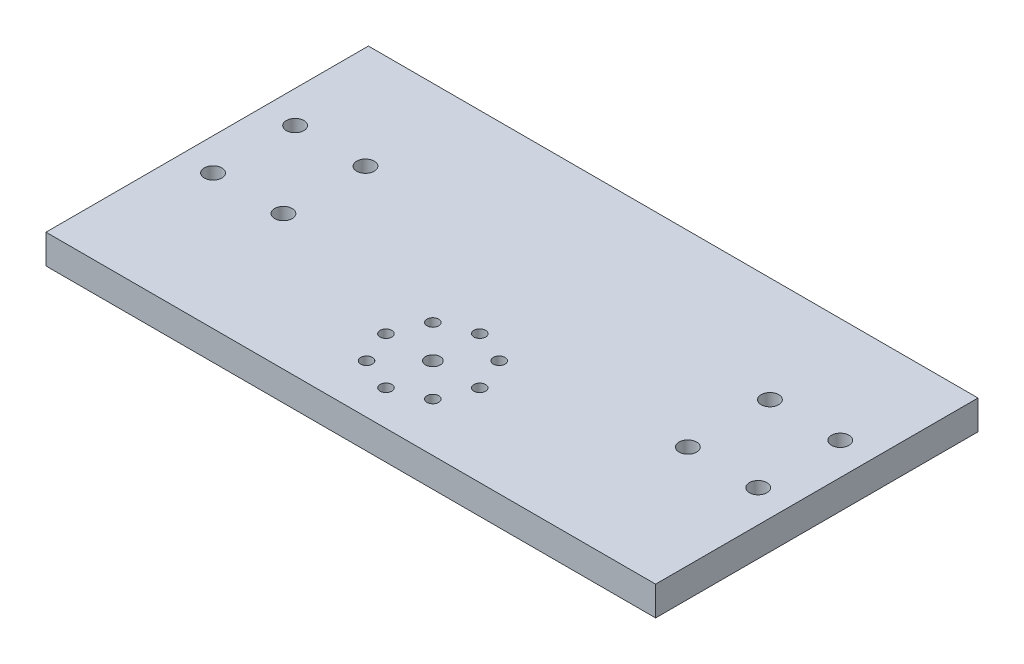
ISO-10303-21;
HEADER;
FILE_DESCRIPTION(('STEP AP214'),'2;1');
FILE_NAME('part.step','',(''),(''),'','','');
FILE_SCHEMA(('AUTOMOTIVE_DESIGN { 1 0 10303 214 1 1 1 1 }'));
ENDSEC;
DATA;
#1=APPLICATION_CONTEXT('core data for automotive mechanical design processes');
#2=APPLICATION_PROTOCOL_DEFINITION('international standard','automotive_design',2000,#1);
#3=PRODUCT_CONTEXT('',#1,'mechanical');
#4=PRODUCT('Part','Part','',(#3));
#5=PRODUCT_RELATED_PRODUCT_CATEGORY('part','',(#4));
#6=PRODUCT_DEFINITION_FORMATION('','',#4);
#7=PRODUCT_DEFINITION_CONTEXT('part definition',#1,'design');
#8=PRODUCT_DEFINITION('design','',#6,#7);
#9=PRODUCT_DEFINITION_SHAPE('','',#8);
#10=(LENGTH_UNIT() NAMED_UNIT(*) SI_UNIT(.MILLI.,.METRE.));
#11=(NAMED_UNIT(*) PLANE_ANGLE_UNIT() SI_UNIT($,.RADIAN.));
#12=(NAMED_UNIT(*) SI_UNIT($,.STERADIAN.) SOLID_ANGLE_UNIT());
#13=UNCERTAINTY_MEASURE_WITH_UNIT(LENGTH_MEASURE(1.E-05),#10,'distance_accuracy_value','');
#14=(GEOMETRIC_REPRESENTATION_CONTEXT(3) GLOBAL_UNCERTAINTY_ASSIGNED_CONTEXT((#13)) GLOBAL_UNIT_ASSIGNED_CONTEXT((#10,
#11,#12)) REPRESENTATION_CONTEXT('',''));
#15=CARTESIAN_POINT('',(0.,0.,0.));
#16=DIRECTION('',(0.,0.,1.));
#17=DIRECTION('',(1.,0.,0.));
#18=AXIS2_PLACEMENT_3D('',#15,#16,#17);
#19=CARTESIAN_POINT('',(0.,5.,16.));
#20=DIRECTION('',(0.,-1.,0.));
#21=DIRECTION('',(0.,0.,-1.));
#22=AXIS2_PLACEMENT_3D('',#19,#20,#21);
#23=CYLINDRICAL_SURFACE('',#22,1.25);
#24=CARTESIAN_POINT('',(0.,5.,16.));
#25=DIRECTION('',(0.,-1.,0.));
#26=DIRECTION('',(0.,0.,-1.));
#27=AXIS2_PLACEMENT_3D('',#24,#25,#26);
#28=CIRCLE('',#27,1.25);
#29=CARTESIAN_POINT('',(0.,5.,14.75));
#30=VERTEX_POINT('',#29);
#31=EDGE_CURVE('E113',#30,#30,#28,.T.);
#32=ORIENTED_EDGE('',*,*,#31,.F.);
#33=EDGE_LOOP('',(#32));
#34=FACE_BOUND('',#33,.T.);
#35=CARTESIAN_POINT('',(0.,2.,16.));
#36=DIRECTION('',(0.,-1.,0.));
#37=DIRECTION('',(0.,0.,-1.));
#38=AXIS2_PLACEMENT_3D('',#35,#36,#37);
#39=CIRCLE('',#38,1.25);
#40=CARTESIAN_POINT('',(0.,2.,14.75));
#41=VERTEX_POINT('',#40);
#42=EDGE_CURVE('E48',#41,#41,#39,.F.);
#43=ORIENTED_EDGE('',*,*,#42,.F.);
#44=EDGE_LOOP('',(#43));
#45=FACE_BOUND('',#44,.T.);
#46=ADVANCED_FACE('F44',(#34,#45),#23,.F.);
#47=CARTESIAN_POINT('',(0.,5.,0.));
#48=DIRECTION('',(0.,-1.,0.));
#49=DIRECTION('',(0.,0.,-1.));
#50=AXIS2_PLACEMENT_3D('',#47,#48,#49);
#51=PLANE('',#50);
#52=CARTESIAN_POINT('',(0.,5.,24.));
#53=DIRECTION('',(0.,-1.,0.));
#54=DIRECTION('',(0.,0.,-1.));
#55=AXIS2_PLACEMENT_3D('',#52,#53,#54);
#56=CIRCLE('',#55,1.);
#57=CARTESIAN_POINT('',(0.,5.,23.));
#58=VERTEX_POINT('',#57);
#59=EDGE_CURVE('E626',#58,#58,#56,.T.);
#60=ORIENTED_EDGE('',*,*,#59,.T.);
#61=EDGE_LOOP('',(#60));
#62=FACE_BOUND('',#61,.T.);
#63=CARTESIAN_POINT('',(5.65685424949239,5.,21.6568542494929));
#64=DIRECTION('',(0.,-1.,0.));
#65=DIRECTION('',(0.,0.,-1.));
#66=AXIS2_PLACEMENT_3D('',#63,#64,#65);
#67=CIRCLE('',#66,1.);
#68=CARTESIAN_POINT('',(5.65685424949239,5.,20.6568542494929));
#69=VERTEX_POINT('',#68);
#70=EDGE_CURVE('E634',#69,#69,#67,.T.);
#71=ORIENTED_EDGE('',*,*,#70,.T.);
#72=EDGE_LOOP('',(#71));
#73=FACE_BOUND('',#72,.T.);
#74=CARTESIAN_POINT('',(8.00000000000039,5.,16.0000000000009));
#75=DIRECTION('',(0.,-1.,0.));
#76=DIRECTION('',(0.,0.,-1.));
#77=AXIS2_PLACEMENT_3D('',#74,#75,#76);
#78=CIRCLE('',#77,1.);
#79=CARTESIAN_POINT('',(8.00000000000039,5.,15.0000000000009));
#80=VERTEX_POINT('',#79);
#81=EDGE_CURVE('E642',#80,#80,#78,.T.);
#82=ORIENTED_EDGE('',*,*,#81,.T.);
#83=EDGE_LOOP('',(#82));
#84=FACE_BOUND('',#83,.T.);
#85=CARTESIAN_POINT('',(5.65685424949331,5.,10.3431457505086));
#86=DIRECTION('',(0.,-1.,0.));
#87=DIRECTION('',(0.,0.,-1.));
#88=AXIS2_PLACEMENT_3D('',#85,#86,#87);
#89=CIRCLE('',#88,1.);
#90=CARTESIAN_POINT('',(5.65685424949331,5.,9.34314575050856));
#91=VERTEX_POINT('',#90);
#92=EDGE_CURVE('E594',#91,#91,#89,.T.);
#93=ORIENTED_EDGE('',*,*,#92,.T.);
#94=EDGE_LOOP('',(#93));
#95=FACE_BOUND('',#94,.T.);
#96=CARTESIAN_POINT('',(1.30445948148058E-12,5.,8.00000000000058));
#97=DIRECTION('',(0.,-1.,0.));
#98=DIRECTION('',(0.,0.,-1.));
#99=AXIS2_PLACEMENT_3D('',#96,#97,#98);
#100=CIRCLE('',#99,1.);
#101=CARTESIAN_POINT('',(1.30445948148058E-12,5.,7.00000000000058));
#102=VERTEX_POINT('',#101);
#103=EDGE_CURVE('E595',#102,#102,#100,.T.);
#104=ORIENTED_EDGE('',*,*,#103,.T.);
#105=EDGE_LOOP('',(#104));
#106=FACE_BOUND('',#105,.T.);
#107=CARTESIAN_POINT('',(-5.65685424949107,5.,10.3431457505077));
#108=DIRECTION('',(0.,-1.,0.));
#109=DIRECTION('',(0.,0.,-1.));
#110=AXIS2_PLACEMENT_3D('',#107,#108,#109);
#111=CIRCLE('',#110,1.);
#112=CARTESIAN_POINT('',(-5.65685424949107,5.,9.34314575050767));
#113=VERTEX_POINT('',#112);
#114=EDGE_CURVE('E603',#113,#113,#111,.T.);
#115=ORIENTED_EDGE('',*,*,#114,.T.);
#116=EDGE_LOOP('',(#115));
#117=FACE_BOUND('',#116,.T.);
#118=CARTESIAN_POINT('',(-7.99999999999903,5.,15.9999999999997));
#119=DIRECTION('',(0.,-1.,0.));
#120=DIRECTION('',(0.,0.,-1.));
#121=AXIS2_PLACEMENT_3D('',#118,#119,#120);
#122=CIRCLE('',#121,1.);
#123=CARTESIAN_POINT('',(-7.99999999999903,5.,14.9999999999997));
#124=VERTEX_POINT('',#123);
#125=EDGE_CURVE('E611',#124,#124,#122,.T.);
#126=ORIENTED_EDGE('',*,*,#125,.T.);
#127=EDGE_LOOP('',(#126));
#128=FACE_BOUND('',#127,.T.);
#129=CARTESIAN_POINT('',(-5.65685424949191,5.,21.6568542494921));
#130=DIRECTION('',(0.,-1.,0.));
#131=DIRECTION('',(0.,0.,-1.));
#132=AXIS2_PLACEMENT_3D('',#129,#130,#131);
#133=CIRCLE('',#132,1.);
#134=CARTESIAN_POINT('',(-5.65685424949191,5.,20.6568542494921));
#135=VERTEX_POINT('',#134);
#136=EDGE_CURVE('E619',#135,#135,#133,.T.);
#137=ORIENTED_EDGE('',*,*,#136,.T.);
#138=EDGE_LOOP('',(#137));
#139=FACE_BOUND('',#138,.T.);
#140=ORIENTED_EDGE('',*,*,#31,.T.);
#141=EDGE_LOOP('',(#140));
#142=FACE_BOUND('',#141,.T.);
#143=DIRECTION('',(0.,0.,-1.));
#144=VECTOR('',#143,1.);
#145=CARTESIAN_POINT('',(52.,5.,25.));
#146=LINE('',#145,#144);
#147=CARTESIAN_POINT('',(52.,5.,30.));
#148=VERTEX_POINT('',#147);
#149=CARTESIAN_POINT('',(52.,5.,-25.));
#150=VERTEX_POINT('',#149);
#151=EDGE_CURVE('E96',#148,#150,#146,.T.);
#152=ORIENTED_EDGE('',*,*,#151,.T.);
#153=DIRECTION('',(-1.,0.,0.));
#154=VECTOR('',#153,1.);
#155=CARTESIAN_POINT('',(-52.,5.,-25.));
#156=LINE('',#155,#154);
#157=CARTESIAN_POINT('',(-52.,5.,-25.));
#158=VERTEX_POINT('',#157);
#159=EDGE_CURVE('E63',#150,#158,#156,.T.);
#160=ORIENTED_EDGE('',*,*,#159,.T.);
#161=DIRECTION('',(0.,0.,1.));
#162=VECTOR('',#161,1.);
#163=CARTESIAN_POINT('',(-52.,5.,25.));
#164=LINE('',#163,#162);
#165=CARTESIAN_POINT('',(-52.,5.,30.));
#166=VERTEX_POINT('',#165);
#167=EDGE_CURVE('E78',#158,#166,#164,.T.);
#168=ORIENTED_EDGE('',*,*,#167,.T.);
#169=DIRECTION('',(-1.,0.,0.));
#170=VECTOR('',#169,1.);
#171=CARTESIAN_POINT('',(-52.,5.,30.));
#172=LINE('',#171,#170);
#173=EDGE_CURVE('E111',#148,#166,#172,.T.);
#174=ORIENTED_EDGE('',*,*,#173,.F.);
#175=EDGE_LOOP('',(#152,#160,#168,#174));
#176=FACE_BOUND('',#175,.T.);
#177=CARTESIAN_POINT('',(-46.5,5.,-7.));
#178=DIRECTION('',(0.,1.,0.));
#179=DIRECTION('',(0.,0.,1.));
#180=AXIS2_PLACEMENT_3D('',#177,#178,#179);
#181=CIRCLE('',#180,1.5);
#182=CARTESIAN_POINT('',(-46.5,5.,-5.5));
#183=VERTEX_POINT('',#182);
#184=EDGE_CURVE('E182',#183,#183,#181,.T.);
#185=ORIENTED_EDGE('',*,*,#184,.F.);
#186=EDGE_LOOP('',(#185));
#187=FACE_BOUND('',#186,.T.);
#188=CARTESIAN_POINT('',(-34.5,5.,-7.));
#189=DIRECTION('',(0.,1.,0.));
#190=DIRECTION('',(0.,0.,1.));
#191=AXIS2_PLACEMENT_3D('',#188,#189,#190);
#192=CIRCLE('',#191,1.5);
#193=CARTESIAN_POINT('',(-34.5,5.,-5.5));
#194=VERTEX_POINT('',#193);
#195=EDGE_CURVE('E174',#194,#194,#192,.T.);
#196=ORIENTED_EDGE('',*,*,#195,.F.);
#197=EDGE_LOOP('',(#196));
#198=FACE_BOUND('',#197,.T.);
#199=CARTESIAN_POINT('',(-34.5,5.,7.));
#200=DIRECTION('',(0.,1.,0.));
#201=DIRECTION('',(0.,0.,-1.));
#202=AXIS2_PLACEMENT_3D('',#199,#200,#201);
#203=CIRCLE('',#202,1.5);
#204=CARTESIAN_POINT('',(-34.5,5.,5.5));
#205=VERTEX_POINT('',#204);
#206=EDGE_CURVE('E166',#205,#205,#203,.T.);
#207=ORIENTED_EDGE('',*,*,#206,.F.);
#208=EDGE_LOOP('',(#207));
#209=FACE_BOUND('',#208,.T.);
#210=CARTESIAN_POINT('',(-46.5,5.,7.));
#211=DIRECTION('',(0.,1.,0.));
#212=DIRECTION('',(0.,0.,-1.));
#213=AXIS2_PLACEMENT_3D('',#210,#211,#212);
#214=CIRCLE('',#213,1.50000000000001);
#215=CARTESIAN_POINT('',(-46.5,5.,5.49999999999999));
#216=VERTEX_POINT('',#215);
#217=EDGE_CURVE('E158',#216,#216,#214,.T.);
#218=ORIENTED_EDGE('',*,*,#217,.F.);
#219=EDGE_LOOP('',(#218));
#220=FACE_BOUND('',#219,.T.);
#221=CARTESIAN_POINT('',(34.5,5.,6.99999999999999));
#222=DIRECTION('',(0.,1.,0.));
#223=DIRECTION('',(0.,0.,1.));
#224=AXIS2_PLACEMENT_3D('',#221,#222,#223);
#225=CIRCLE('',#224,1.5);
#226=CARTESIAN_POINT('',(34.5,5.,8.49999999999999));
#227=VERTEX_POINT('',#226);
#228=EDGE_CURVE('E150',#227,#227,#225,.T.);
#229=ORIENTED_EDGE('',*,*,#228,.F.);
#230=EDGE_LOOP('',(#229));
#231=FACE_BOUND('',#230,.T.);
#232=CARTESIAN_POINT('',(46.5,5.,7.));
#233=DIRECTION('',(0.,1.,0.));
#234=DIRECTION('',(0.,0.,1.));
#235=AXIS2_PLACEMENT_3D('',#232,#233,#234);
#236=CIRCLE('',#235,1.50000000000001);
#237=CARTESIAN_POINT('',(46.5,5.,8.50000000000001));
#238=VERTEX_POINT('',#237);
#239=EDGE_CURVE('E142',#238,#238,#236,.T.);
#240=ORIENTED_EDGE('',*,*,#239,.F.);
#241=EDGE_LOOP('',(#240));
#242=FACE_BOUND('',#241,.T.);
#243=CARTESIAN_POINT('',(34.5,5.,-7.00000000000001));
#244=DIRECTION('',(0.,1.,0.));
#245=DIRECTION('',(0.,0.,-1.));
#246=AXIS2_PLACEMENT_3D('',#243,#244,#245);
#247=CIRCLE('',#246,1.5);
#248=CARTESIAN_POINT('',(34.5,5.,-8.50000000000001));
#249=VERTEX_POINT('',#248);
#250=EDGE_CURVE('E134',#249,#249,#247,.T.);
#251=ORIENTED_EDGE('',*,*,#250,.F.);
#252=EDGE_LOOP('',(#251));
#253=FACE_BOUND('',#252,.T.);
#254=CARTESIAN_POINT('',(46.5,5.,-7.));
#255=DIRECTION('',(0.,1.,0.));
#256=DIRECTION('',(0.,0.,-1.));
#257=AXIS2_PLACEMENT_3D('',#254,#255,#256);
#258=CIRCLE('',#257,1.5);
#259=CARTESIAN_POINT('',(46.5,5.,-8.5));
#260=VERTEX_POINT('',#259);
#261=EDGE_CURVE('E126',#260,#260,#258,.T.);
#262=ORIENTED_EDGE('',*,*,#261,.F.);
#263=EDGE_LOOP('',(#262));
#264=FACE_BOUND('',#263,.T.);
#265=ADVANCED_FACE('F204',(#62,#73,#84,#95,#106,#117,#128,#139,#142,#176,#187,#198,#209,#220,
#231,#242,#253,#264),#51,.F.);
#266=CARTESIAN_POINT('',(0.,0.,0.));
#267=DIRECTION('',(0.,-1.,0.));
#268=DIRECTION('',(0.,0.,-1.));
#269=AXIS2_PLACEMENT_3D('',#266,#267,#268);
#270=PLANE('',#269);
#271=CARTESIAN_POINT('',(0.,0.,16.));
#272=DIRECTION('',(0.,-1.,0.));
#273=DIRECTION('',(0.,0.,-1.));
#274=AXIS2_PLACEMENT_3D('',#271,#272,#273);
#275=CIRCLE('',#274,4.);
#276=CARTESIAN_POINT('',(0.,0.,12.));
#277=VERTEX_POINT('',#276);
#278=EDGE_CURVE('E584',#277,#277,#275,.T.);
#279=ORIENTED_EDGE('',*,*,#278,.F.);
#280=EDGE_LOOP('',(#279));
#281=FACE_BOUND('',#280,.T.);
#282=CARTESIAN_POINT('',(0.,0.,24.));
#283=DIRECTION('',(0.,-1.,0.));
#284=DIRECTION('',(0.,0.,-1.));
#285=AXIS2_PLACEMENT_3D('',#282,#283,#284);
#286=CIRCLE('',#285,1.);
#287=CARTESIAN_POINT('',(0.,0.,23.));
#288=VERTEX_POINT('',#287);
#289=EDGE_CURVE('E117',#288,#288,#286,.T.);
#290=ORIENTED_EDGE('',*,*,#289,.F.);
#291=EDGE_LOOP('',(#290));
#292=FACE_BOUND('',#291,.T.);
#293=CARTESIAN_POINT('',(5.65685424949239,0.,21.6568542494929));
#294=DIRECTION('',(0.,-1.,0.));
#295=DIRECTION('',(0.,0.,-1.));
#296=AXIS2_PLACEMENT_3D('',#293,#294,#295);
#297=CIRCLE('',#296,1.);
#298=CARTESIAN_POINT('',(5.65685424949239,0.,20.6568542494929));
#299=VERTEX_POINT('',#298);
#300=EDGE_CURVE('E630',#299,#299,#297,.T.);
#301=ORIENTED_EDGE('',*,*,#300,.F.);
#302=EDGE_LOOP('',(#301));
#303=FACE_BOUND('',#302,.T.);
#304=CARTESIAN_POINT('',(8.00000000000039,0.,16.0000000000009));
#305=DIRECTION('',(0.,-1.,0.));
#306=DIRECTION('',(0.,0.,-1.));
#307=AXIS2_PLACEMENT_3D('',#304,#305,#306);
#308=CIRCLE('',#307,1.);
#309=CARTESIAN_POINT('',(8.00000000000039,0.,15.0000000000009));
#310=VERTEX_POINT('',#309);
#311=EDGE_CURVE('E638',#310,#310,#308,.T.);
#312=ORIENTED_EDGE('',*,*,#311,.F.);
#313=EDGE_LOOP('',(#312));
#314=FACE_BOUND('',#313,.T.);
#315=CARTESIAN_POINT('',(5.65685424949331,0.,10.3431457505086));
#316=DIRECTION('',(0.,-1.,0.));
#317=DIRECTION('',(0.,0.,-1.));
#318=AXIS2_PLACEMENT_3D('',#315,#316,#317);
#319=CIRCLE('',#318,1.);
#320=CARTESIAN_POINT('',(5.65685424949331,0.,9.34314575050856));
#321=VERTEX_POINT('',#320);
#322=EDGE_CURVE('E646',#321,#321,#319,.T.);
#323=ORIENTED_EDGE('',*,*,#322,.F.);
#324=EDGE_LOOP('',(#323));
#325=FACE_BOUND('',#324,.T.);
#326=CARTESIAN_POINT('',(1.30445948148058E-12,0.,8.00000000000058));
#327=DIRECTION('',(0.,-1.,0.));
#328=DIRECTION('',(0.,0.,-1.));
#329=AXIS2_PLACEMENT_3D('',#326,#327,#328);
#330=CIRCLE('',#329,1.);
#331=CARTESIAN_POINT('',(1.30445948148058E-12,0.,7.00000000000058));
#332=VERTEX_POINT('',#331);
#333=EDGE_CURVE('E590',#332,#332,#330,.T.);
#334=ORIENTED_EDGE('',*,*,#333,.F.);
#335=EDGE_LOOP('',(#334));
#336=FACE_BOUND('',#335,.T.);
#337=CARTESIAN_POINT('',(-5.65685424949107,0.,10.3431457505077));
#338=DIRECTION('',(0.,-1.,0.));
#339=DIRECTION('',(0.,0.,-1.));
#340=AXIS2_PLACEMENT_3D('',#337,#338,#339);
#341=CIRCLE('',#340,1.);
#342=CARTESIAN_POINT('',(-5.65685424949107,0.,9.34314575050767));
#343=VERTEX_POINT('',#342);
#344=EDGE_CURVE('E599',#343,#343,#341,.T.);
#345=ORIENTED_EDGE('',*,*,#344,.F.);
#346=EDGE_LOOP('',(#345));
#347=FACE_BOUND('',#346,.T.);
#348=CARTESIAN_POINT('',(-7.99999999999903,0.,15.9999999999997));
#349=DIRECTION('',(0.,-1.,0.));
#350=DIRECTION('',(0.,0.,-1.));
#351=AXIS2_PLACEMENT_3D('',#348,#349,#350);
#352=CIRCLE('',#351,1.);
#353=CARTESIAN_POINT('',(-7.99999999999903,0.,14.9999999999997));
#354=VERTEX_POINT('',#353);
#355=EDGE_CURVE('E607',#354,#354,#352,.T.);
#356=ORIENTED_EDGE('',*,*,#355,.F.);
#357=EDGE_LOOP('',(#356));
#358=FACE_BOUND('',#357,.T.);
#359=CARTESIAN_POINT('',(-5.65685424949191,0.,21.6568542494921));
#360=DIRECTION('',(0.,-1.,0.));
#361=DIRECTION('',(0.,0.,-1.));
#362=AXIS2_PLACEMENT_3D('',#359,#360,#361);
#363=CIRCLE('',#362,1.);
#364=CARTESIAN_POINT('',(-5.65685424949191,0.,20.6568542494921));
#365=VERTEX_POINT('',#364);
#366=EDGE_CURVE('E615',#365,#365,#363,.T.);
#367=ORIENTED_EDGE('',*,*,#366,.F.);
#368=EDGE_LOOP('',(#367));
#369=FACE_BOUND('',#368,.T.);
#370=CARTESIAN_POINT('',(34.5,0.,-7.00000000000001));
#371=DIRECTION('',(0.,1.,0.));
#372=DIRECTION('',(0.,0.,-1.));
#373=AXIS2_PLACEMENT_3D('',#370,#371,#372);
#374=CIRCLE('',#373,1.5);
#375=CARTESIAN_POINT('',(34.5,0.,-8.50000000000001));
#376=VERTEX_POINT('',#375);
#377=EDGE_CURVE('E130',#376,#376,#374,.T.);
#378=ORIENTED_EDGE('',*,*,#377,.T.);
#379=EDGE_LOOP('',(#378));
#380=FACE_BOUND('',#379,.T.);
#381=CARTESIAN_POINT('',(34.5,0.,6.99999999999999));
#382=DIRECTION('',(0.,1.,0.));
#383=DIRECTION('',(0.,0.,1.));
#384=AXIS2_PLACEMENT_3D('',#381,#382,#383);
#385=CIRCLE('',#384,1.5);
#386=CARTESIAN_POINT('',(34.5,0.,8.49999999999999));
#387=VERTEX_POINT('',#386);
#388=EDGE_CURVE('E146',#387,#387,#385,.T.);
#389=ORIENTED_EDGE('',*,*,#388,.T.);
#390=EDGE_LOOP('',(#389));
#391=FACE_BOUND('',#390,.T.);
#392=CARTESIAN_POINT('',(-34.5,0.,7.));
#393=DIRECTION('',(0.,1.,0.));
#394=DIRECTION('',(0.,0.,-1.));
#395=AXIS2_PLACEMENT_3D('',#392,#393,#394);
#396=CIRCLE('',#395,1.5);
#397=CARTESIAN_POINT('',(-34.5,0.,5.5));
#398=VERTEX_POINT('',#397);
#399=EDGE_CURVE('E162',#398,#398,#396,.T.);
#400=ORIENTED_EDGE('',*,*,#399,.T.);
#401=EDGE_LOOP('',(#400));
#402=FACE_BOUND('',#401,.T.);
#403=CARTESIAN_POINT('',(-46.5,0.,-7.));
#404=DIRECTION('',(0.,1.,0.));
#405=DIRECTION('',(0.,0.,1.));
#406=AXIS2_PLACEMENT_3D('',#403,#404,#405);
#407=CIRCLE('',#406,1.5);
#408=CARTESIAN_POINT('',(-46.5,0.,-5.5));
#409=VERTEX_POINT('',#408);
#410=EDGE_CURVE('E178',#409,#409,#407,.T.);
#411=ORIENTED_EDGE('',*,*,#410,.T.);
#412=EDGE_LOOP('',(#411));
#413=FACE_BOUND('',#412,.T.);
#414=DIRECTION('',(0.,0.,-1.));
#415=VECTOR('',#414,1.);
#416=CARTESIAN_POINT('',(52.,0.,25.));
#417=LINE('',#416,#415);
#418=CARTESIAN_POINT('',(52.,0.,30.));
#419=VERTEX_POINT('',#418);
#420=CARTESIAN_POINT('',(52.,0.,-25.));
#421=VERTEX_POINT('',#420);
#422=EDGE_CURVE('E103',#419,#421,#417,.T.);
#423=ORIENTED_EDGE('',*,*,#422,.F.);
#424=DIRECTION('',(1.,0.,0.));
#425=VECTOR('',#424,1.);
#426=CARTESIAN_POINT('',(-52.,0.,30.));
#427=LINE('',#426,#425);
#428=CARTESIAN_POINT('',(-52.,0.,30.));
#429=VERTEX_POINT('',#428);
#430=EDGE_CURVE('E99',#429,#419,#427,.T.);
#431=ORIENTED_EDGE('',*,*,#430,.F.);
#432=DIRECTION('',(0.,0.,1.));
#433=VECTOR('',#432,1.);
#434=CARTESIAN_POINT('',(-52.,0.,25.));
#435=LINE('',#434,#433);
#436=CARTESIAN_POINT('',(-52.,0.,-25.));
#437=VERTEX_POINT('',#436);
#438=EDGE_CURVE('E90',#437,#429,#435,.T.);
#439=ORIENTED_EDGE('',*,*,#438,.F.);
#440=DIRECTION('',(-1.,0.,0.));
#441=VECTOR('',#440,1.);
#442=CARTESIAN_POINT('',(-52.,0.,-25.));
#443=LINE('',#442,#441);
#444=EDGE_CURVE('E74',#421,#437,#443,.T.);
#445=ORIENTED_EDGE('',*,*,#444,.F.);
#446=EDGE_LOOP('',(#423,#431,#439,#445));
#447=FACE_BOUND('',#446,.T.);
#448=CARTESIAN_POINT('',(-34.5,0.,-7.));
#449=DIRECTION('',(0.,1.,0.));
#450=DIRECTION('',(0.,0.,1.));
#451=AXIS2_PLACEMENT_3D('',#448,#449,#450);
#452=CIRCLE('',#451,1.5);
#453=CARTESIAN_POINT('',(-34.5,0.,-5.5));
#454=VERTEX_POINT('',#453);
#455=EDGE_CURVE('E170',#454,#454,#452,.T.);
#456=ORIENTED_EDGE('',*,*,#455,.T.);
#457=EDGE_LOOP('',(#456));
#458=FACE_BOUND('',#457,.T.);
#459=CARTESIAN_POINT('',(-46.5,0.,7.));
#460=DIRECTION('',(0.,1.,0.));
#461=DIRECTION('',(0.,0.,-1.));
#462=AXIS2_PLACEMENT_3D('',#459,#460,#461);
#463=CIRCLE('',#462,1.50000000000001);
#464=CARTESIAN_POINT('',(-46.5,0.,5.49999999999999));
#465=VERTEX_POINT('',#464);
#466=EDGE_CURVE('E154',#465,#465,#463,.T.);
#467=ORIENTED_EDGE('',*,*,#466,.T.);
#468=EDGE_LOOP('',(#467));
#469=FACE_BOUND('',#468,.T.);
#470=CARTESIAN_POINT('',(46.5,0.,7.));
#471=DIRECTION('',(0.,1.,0.));
#472=DIRECTION('',(0.,0.,1.));
#473=AXIS2_PLACEMENT_3D('',#470,#471,#472);
#474=CIRCLE('',#473,1.50000000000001);
#475=CARTESIAN_POINT('',(46.5,0.,8.50000000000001));
#476=VERTEX_POINT('',#475);
#477=EDGE_CURVE('E138',#476,#476,#474,.T.);
#478=ORIENTED_EDGE('',*,*,#477,.T.);
#479=EDGE_LOOP('',(#478));
#480=FACE_BOUND('',#479,.T.);
#481=CARTESIAN_POINT('',(46.5,0.,-7.));
#482=DIRECTION('',(0.,1.,0.));
#483=DIRECTION('',(0.,0.,-1.));
#484=AXIS2_PLACEMENT_3D('',#481,#482,#483);
#485=CIRCLE('',#484,1.5);
#486=CARTESIAN_POINT('',(46.5,0.,-8.5));
#487=VERTEX_POINT('',#486);
#488=EDGE_CURVE('E125',#487,#487,#485,.T.);
#489=ORIENTED_EDGE('',*,*,#488,.T.);
#490=EDGE_LOOP('',(#489));
#491=FACE_BOUND('',#490,.T.);
#492=ADVANCED_FACE('F100',(#281,#292,#303,#314,#325,#336,#347,#358,#369,#380,#391,#402,#413,
#447,#458,#469,#480,#491),#270,.T.);
#493=CARTESIAN_POINT('',(52.,5.,25.));
#494=DIRECTION('',(-1.,0.,0.));
#495=DIRECTION('',(0.,0.,1.));
#496=AXIS2_PLACEMENT_3D('',#493,#494,#495);
#497=PLANE('',#496);
#498=ORIENTED_EDGE('',*,*,#422,.T.);
#499=DIRECTION('',(0.,-1.,0.));
#500=VECTOR('',#499,1.);
#501=CARTESIAN_POINT('',(52.,5.,-25.));
#502=LINE('',#501,#500);
#503=EDGE_CURVE('E11',#150,#421,#502,.T.);
#504=ORIENTED_EDGE('',*,*,#503,.F.);
#505=ORIENTED_EDGE('',*,*,#151,.F.);
#506=DIRECTION('',(0.,1.,0.));
#507=VECTOR('',#506,1.);
#508=CARTESIAN_POINT('',(52.,0.,30.));
#509=LINE('',#508,#507);
#510=EDGE_CURVE('E108',#419,#148,#509,.T.);
#511=ORIENTED_EDGE('',*,*,#510,.F.);
#512=EDGE_LOOP('',(#498,#504,#505,#511));
#513=FACE_BOUND('',#512,.T.);
#514=ADVANCED_FACE('F46',(#513),#497,.F.);
#515=CARTESIAN_POINT('',(-52.,5.,-25.));
#516=DIRECTION('',(0.,0.,1.));
#517=DIRECTION('',(1.,0.,0.));
#518=AXIS2_PLACEMENT_3D('',#515,#516,#517);
#519=PLANE('',#518);
#520=ORIENTED_EDGE('',*,*,#444,.T.);
#521=DIRECTION('',(0.,-1.,0.));
#522=VECTOR('',#521,1.);
#523=CARTESIAN_POINT('',(-52.,5.,-25.));
#524=LINE('',#523,#522);
#525=EDGE_CURVE('E55',#158,#437,#524,.T.);
#526=ORIENTED_EDGE('',*,*,#525,.F.);
#527=ORIENTED_EDGE('',*,*,#159,.F.);
#528=ORIENTED_EDGE('',*,*,#503,.T.);
#529=EDGE_LOOP('',(#520,#526,#527,#528));
#530=FACE_BOUND('',#529,.T.);
#531=ADVANCED_FACE('F201',(#530),#519,.F.);
#532=CARTESIAN_POINT('',(-52.,5.,25.));
#533=DIRECTION('',(1.,0.,0.));
#534=DIRECTION('',(0.,0.,-1.));
#535=AXIS2_PLACEMENT_3D('',#532,#533,#534);
#536=PLANE('',#535);
#537=ORIENTED_EDGE('',*,*,#438,.T.);
#538=DIRECTION('',(0.,-1.,0.));
#539=VECTOR('',#538,1.);
#540=CARTESIAN_POINT('',(-52.,0.,30.));
#541=LINE('',#540,#539);
#542=EDGE_CURVE('E94',#166,#429,#541,.T.);
#543=ORIENTED_EDGE('',*,*,#542,.F.);
#544=ORIENTED_EDGE('',*,*,#167,.F.);
#545=ORIENTED_EDGE('',*,*,#525,.T.);
#546=EDGE_LOOP('',(#537,#543,#544,#545));
#547=FACE_BOUND('',#546,.T.);
#548=ADVANCED_FACE('F92',(#547),#536,.F.);
#549=CARTESIAN_POINT('',(-46.5,5.,-7.));
#550=DIRECTION('',(0.,-1.,0.));
#551=DIRECTION('',(0.,0.,-1.));
#552=AXIS2_PLACEMENT_3D('',#549,#550,#551);
#553=CYLINDRICAL_SURFACE('',#552,1.5);
#554=ORIENTED_EDGE('',*,*,#184,.T.);
#555=EDGE_LOOP('',(#554));
#556=FACE_BOUND('',#555,.T.);
#557=ORIENTED_EDGE('',*,*,#410,.F.);
#558=EDGE_LOOP('',(#557));
#559=FACE_BOUND('',#558,.T.);
#560=ADVANCED_FACE('F280',(#556,#559),#553,.F.);
#561=CARTESIAN_POINT('',(-34.5,5.,-7.));
#562=DIRECTION('',(0.,-1.,0.));
#563=DIRECTION('',(0.,0.,-1.));
#564=AXIS2_PLACEMENT_3D('',#561,#562,#563);
#565=CYLINDRICAL_SURFACE('',#564,1.5);
#566=ORIENTED_EDGE('',*,*,#195,.T.);
#567=EDGE_LOOP('',(#566));
#568=FACE_BOUND('',#567,.T.);
#569=ORIENTED_EDGE('',*,*,#455,.F.);
#570=EDGE_LOOP('',(#569));
#571=FACE_BOUND('',#570,.T.);
#572=ADVANCED_FACE('F276',(#568,#571),#565,.F.);
#573=CARTESIAN_POINT('',(-34.5,5.,7.));
#574=DIRECTION('',(0.,-1.,0.));
#575=DIRECTION('',(0.,0.,-1.));
#576=AXIS2_PLACEMENT_3D('',#573,#574,#575);
#577=CYLINDRICAL_SURFACE('',#576,1.5);
#578=ORIENTED_EDGE('',*,*,#206,.T.);
#579=EDGE_LOOP('',(#578));
#580=FACE_BOUND('',#579,.T.);
#581=ORIENTED_EDGE('',*,*,#399,.F.);
#582=EDGE_LOOP('',(#581));
#583=FACE_BOUND('',#582,.T.);
#584=ADVANCED_FACE('F272',(#580,#583),#577,.F.);
#585=CARTESIAN_POINT('',(-46.5,5.,7.));
#586=DIRECTION('',(0.,-1.,0.));
#587=DIRECTION('',(0.,0.,-1.));
#588=AXIS2_PLACEMENT_3D('',#585,#586,#587);
#589=CYLINDRICAL_SURFACE('',#588,1.50000000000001);
#590=ORIENTED_EDGE('',*,*,#217,.T.);
#591=EDGE_LOOP('',(#590));
#592=FACE_BOUND('',#591,.T.);
#593=ORIENTED_EDGE('',*,*,#466,.F.);
#594=EDGE_LOOP('',(#593));
#595=FACE_BOUND('',#594,.T.);
#596=ADVANCED_FACE('F268',(#592,#595),#589,.F.);
#597=CARTESIAN_POINT('',(34.5,5.,6.99999999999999));
#598=DIRECTION('',(0.,-1.,0.));
#599=DIRECTION('',(0.,0.,-1.));
#600=AXIS2_PLACEMENT_3D('',#597,#598,#599);
#601=CYLINDRICAL_SURFACE('',#600,1.5);
#602=ORIENTED_EDGE('',*,*,#228,.T.);
#603=EDGE_LOOP('',(#602));
#604=FACE_BOUND('',#603,.T.);
#605=ORIENTED_EDGE('',*,*,#388,.F.);
#606=EDGE_LOOP('',(#605));
#607=FACE_BOUND('',#606,.T.);
#608=ADVANCED_FACE('F264',(#604,#607),#601,.F.);
#609=CARTESIAN_POINT('',(46.5,5.,7.));
#610=DIRECTION('',(0.,-1.,0.));
#611=DIRECTION('',(0.,0.,-1.));
#612=AXIS2_PLACEMENT_3D('',#609,#610,#611);
#613=CYLINDRICAL_SURFACE('',#612,1.50000000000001);
#614=ORIENTED_EDGE('',*,*,#239,.T.);
#615=EDGE_LOOP('',(#614));
#616=FACE_BOUND('',#615,.T.);
#617=ORIENTED_EDGE('',*,*,#477,.F.);
#618=EDGE_LOOP('',(#617));
#619=FACE_BOUND('',#618,.T.);
#620=ADVANCED_FACE('F260',(#616,#619),#613,.F.);
#621=CARTESIAN_POINT('',(34.5,5.,-7.00000000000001));
#622=DIRECTION('',(0.,-1.,0.));
#623=DIRECTION('',(0.,0.,-1.));
#624=AXIS2_PLACEMENT_3D('',#621,#622,#623);
#625=CYLINDRICAL_SURFACE('',#624,1.5);
#626=ORIENTED_EDGE('',*,*,#250,.T.);
#627=EDGE_LOOP('',(#626));
#628=FACE_BOUND('',#627,.T.);
#629=ORIENTED_EDGE('',*,*,#377,.F.);
#630=EDGE_LOOP('',(#629));
#631=FACE_BOUND('',#630,.T.);
#632=ADVANCED_FACE('F228',(#628,#631),#625,.F.);
#633=CARTESIAN_POINT('',(46.5,5.,-7.));
#634=DIRECTION('',(0.,-1.,0.));
#635=DIRECTION('',(0.,0.,-1.));
#636=AXIS2_PLACEMENT_3D('',#633,#634,#635);
#637=CYLINDRICAL_SURFACE('',#636,1.5);
#638=ORIENTED_EDGE('',*,*,#261,.T.);
#639=EDGE_LOOP('',(#638));
#640=FACE_BOUND('',#639,.T.);
#641=ORIENTED_EDGE('',*,*,#488,.F.);
#642=EDGE_LOOP('',(#641));
#643=FACE_BOUND('',#642,.T.);
#644=ADVANCED_FACE('F225',(#640,#643),#637,.F.);
#645=CARTESIAN_POINT('',(0.,0.,30.));
#646=DIRECTION('',(0.,0.,-1.));
#647=DIRECTION('',(-1.,0.,0.));
#648=AXIS2_PLACEMENT_3D('',#645,#646,#647);
#649=PLANE('',#648);
#650=ORIENTED_EDGE('',*,*,#542,.T.);
#651=ORIENTED_EDGE('',*,*,#430,.T.);
#652=ORIENTED_EDGE('',*,*,#510,.T.);
#653=ORIENTED_EDGE('',*,*,#173,.T.);
#654=EDGE_LOOP('',(#650,#651,#652,#653));
#655=FACE_BOUND('',#654,.T.);
#656=ADVANCED_FACE('F110',(#655),#649,.F.);
#657=CARTESIAN_POINT('',(-5.65685424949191,5.,21.6568542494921));
#658=DIRECTION('',(0.,-1.,0.));
#659=DIRECTION('',(0.,0.,-1.));
#660=AXIS2_PLACEMENT_3D('',#657,#658,#659);
#661=CYLINDRICAL_SURFACE('',#660,1.);
#662=ORIENTED_EDGE('',*,*,#136,.F.);
#663=EDGE_LOOP('',(#662));
#664=FACE_BOUND('',#663,.T.);
#665=ORIENTED_EDGE('',*,*,#366,.T.);
#666=EDGE_LOOP('',(#665));
#667=FACE_BOUND('',#666,.T.);
#668=ADVANCED_FACE('F256',(#664,#667),#661,.F.);
#669=CARTESIAN_POINT('',(-7.99999999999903,5.,15.9999999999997));
#670=DIRECTION('',(0.,-1.,0.));
#671=DIRECTION('',(0.,0.,-1.));
#672=AXIS2_PLACEMENT_3D('',#669,#670,#671);
#673=CYLINDRICAL_SURFACE('',#672,1.);
#674=ORIENTED_EDGE('',*,*,#125,.F.);
#675=EDGE_LOOP('',(#674));
#676=FACE_BOUND('',#675,.T.);
#677=ORIENTED_EDGE('',*,*,#355,.T.);
#678=EDGE_LOOP('',(#677));
#679=FACE_BOUND('',#678,.T.);
#680=ADVANCED_FACE('F384',(#676,#679),#673,.F.);
#681=CARTESIAN_POINT('',(-5.65685424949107,5.,10.3431457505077));
#682=DIRECTION('',(0.,-1.,0.));
#683=DIRECTION('',(0.,0.,-1.));
#684=AXIS2_PLACEMENT_3D('',#681,#682,#683);
#685=CYLINDRICAL_SURFACE('',#684,1.);
#686=ORIENTED_EDGE('',*,*,#114,.F.);
#687=EDGE_LOOP('',(#686));
#688=FACE_BOUND('',#687,.T.);
#689=ORIENTED_EDGE('',*,*,#344,.T.);
#690=EDGE_LOOP('',(#689));
#691=FACE_BOUND('',#690,.T.);
#692=ADVANCED_FACE('F394',(#688,#691),#685,.F.);
#693=CARTESIAN_POINT('',(1.30445948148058E-12,5.,8.00000000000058));
#694=DIRECTION('',(0.,-1.,0.));
#695=DIRECTION('',(0.,0.,-1.));
#696=AXIS2_PLACEMENT_3D('',#693,#694,#695);
#697=CYLINDRICAL_SURFACE('',#696,1.);
#698=ORIENTED_EDGE('',*,*,#103,.F.);
#699=EDGE_LOOP('',(#698));
#700=FACE_BOUND('',#699,.T.);
#701=ORIENTED_EDGE('',*,*,#333,.T.);
#702=EDGE_LOOP('',(#701));
#703=FACE_BOUND('',#702,.T.);
#704=ADVANCED_FACE('F404',(#700,#703),#697,.F.);
#705=CARTESIAN_POINT('',(5.65685424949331,5.,10.3431457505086));
#706=DIRECTION('',(0.,-1.,0.));
#707=DIRECTION('',(0.,0.,-1.));
#708=AXIS2_PLACEMENT_3D('',#705,#706,#707);
#709=CYLINDRICAL_SURFACE('',#708,1.);
#710=ORIENTED_EDGE('',*,*,#92,.F.);
#711=EDGE_LOOP('',(#710));
#712=FACE_BOUND('',#711,.T.);
#713=ORIENTED_EDGE('',*,*,#322,.T.);
#714=EDGE_LOOP('',(#713));
#715=FACE_BOUND('',#714,.T.);
#716=ADVANCED_FACE('F254',(#712,#715),#709,.F.);
#717=CARTESIAN_POINT('',(8.00000000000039,5.,16.0000000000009));
#718=DIRECTION('',(0.,-1.,0.));
#719=DIRECTION('',(0.,0.,-1.));
#720=AXIS2_PLACEMENT_3D('',#717,#718,#719);
#721=CYLINDRICAL_SURFACE('',#720,1.);
#722=ORIENTED_EDGE('',*,*,#81,.F.);
#723=EDGE_LOOP('',(#722));
#724=FACE_BOUND('',#723,.T.);
#725=ORIENTED_EDGE('',*,*,#311,.T.);
#726=EDGE_LOOP('',(#725));
#727=FACE_BOUND('',#726,.T.);
#728=ADVANCED_FACE('F423',(#724,#727),#721,.F.);
#729=CARTESIAN_POINT('',(5.65685424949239,5.,21.6568542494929));
#730=DIRECTION('',(0.,-1.,0.));
#731=DIRECTION('',(0.,0.,-1.));
#732=AXIS2_PLACEMENT_3D('',#729,#730,#731);
#733=CYLINDRICAL_SURFACE('',#732,1.);
#734=ORIENTED_EDGE('',*,*,#70,.F.);
#735=EDGE_LOOP('',(#734));
#736=FACE_BOUND('',#735,.T.);
#737=ORIENTED_EDGE('',*,*,#300,.T.);
#738=EDGE_LOOP('',(#737));
#739=FACE_BOUND('',#738,.T.);
#740=ADVANCED_FACE('F432',(#736,#739),#733,.F.);
#741=CARTESIAN_POINT('',(0.,5.,24.));
#742=DIRECTION('',(0.,-1.,0.));
#743=DIRECTION('',(0.,0.,-1.));
#744=AXIS2_PLACEMENT_3D('',#741,#742,#743);
#745=CYLINDRICAL_SURFACE('',#744,1.);
#746=ORIENTED_EDGE('',*,*,#59,.F.);
#747=EDGE_LOOP('',(#746));
#748=FACE_BOUND('',#747,.T.);
#749=ORIENTED_EDGE('',*,*,#289,.T.);
#750=EDGE_LOOP('',(#749));
#751=FACE_BOUND('',#750,.T.);
#752=ADVANCED_FACE('F441',(#748,#751),#745,.F.);
#753=CARTESIAN_POINT('',(0.,2.,16.));
#754=DIRECTION('',(0.,-1.,0.));
#755=DIRECTION('',(0.,0.,-1.));
#756=AXIS2_PLACEMENT_3D('',#753,#754,#755);
#757=PLANE('',#756);
#758=CARTESIAN_POINT('',(0.,2.,16.));
#759=DIRECTION('',(0.,-1.,0.));
#760=DIRECTION('',(0.,0.,-1.));
#761=AXIS2_PLACEMENT_3D('',#758,#759,#760);
#762=CIRCLE('',#761,4.);
#763=CARTESIAN_POINT('',(0.,2.,12.));
#764=VERTEX_POINT('',#763);
#765=EDGE_CURVE('E582',#764,#764,#762,.T.);
#766=ORIENTED_EDGE('',*,*,#765,.T.);
#767=EDGE_LOOP('',(#766));
#768=FACE_BOUND('',#767,.T.);
#769=ORIENTED_EDGE('',*,*,#42,.T.);
#770=EDGE_LOOP('',(#769));
#771=FACE_BOUND('',#770,.T.);
#772=ADVANCED_FACE('F450',(#768,#771),#757,.T.);
#773=CARTESIAN_POINT('',(0.,2.,16.));
#774=DIRECTION('',(0.,-1.,0.));
#775=DIRECTION('',(0.,0.,-1.));
#776=AXIS2_PLACEMENT_3D('',#773,#774,#775);
#777=CYLINDRICAL_SURFACE('',#776,4.);
#778=ORIENTED_EDGE('',*,*,#765,.F.);
#779=EDGE_LOOP('',(#778));
#780=FACE_BOUND('',#779,.T.);
#781=ORIENTED_EDGE('',*,*,#278,.T.);
#782=EDGE_LOOP('',(#781));
#783=FACE_BOUND('',#782,.T.);
#784=ADVANCED_FACE('F459',(#780,#783),#777,.F.);
#785=CLOSED_SHELL('',(#46,#265,#492,#514,#531,#548,#560,#572,#584,#596,#608,#620,#632,#644,#656,
#668,#680,#692,#704,#716,#728,#740,#752,#772,#784));
#786=MANIFOLD_SOLID_BREP('B2',#785);
#787=ADVANCED_BREP_SHAPE_REPRESENTATION('',(#18,#786),#14);
#788=SHAPE_DEFINITION_REPRESENTATION(#9,#787);
ENDSEC;
END-ISO-10303-21;
